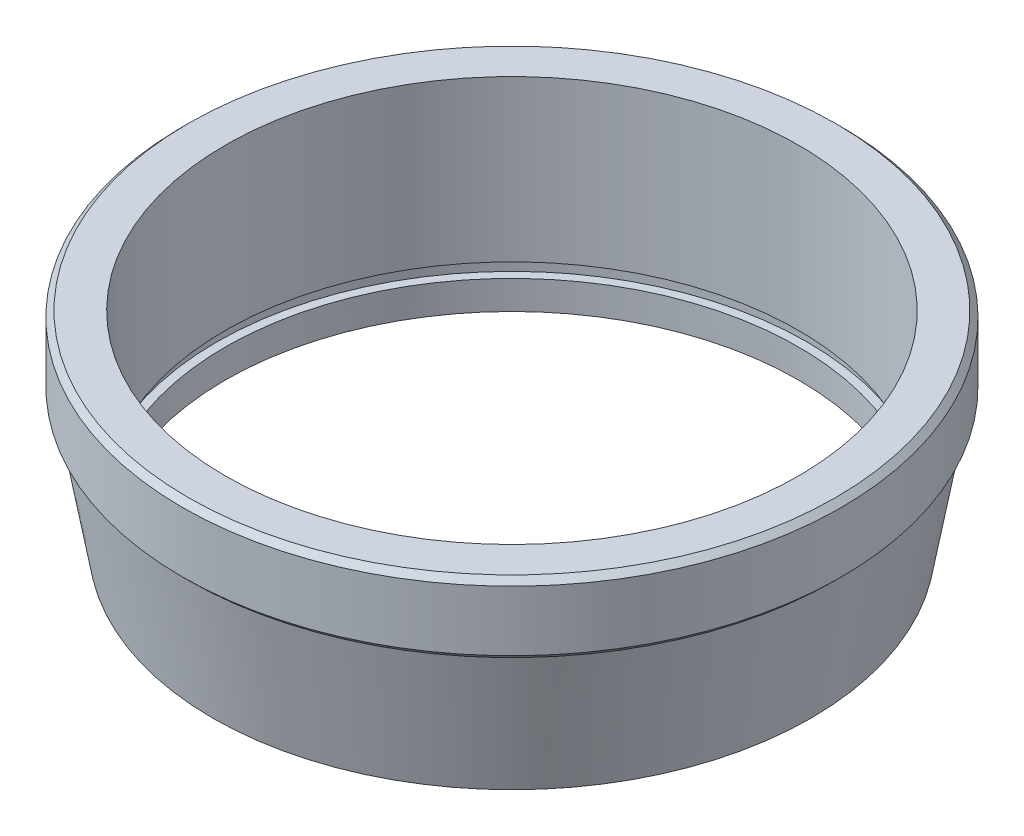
from build123d import *

# Parameters (mm, degrees)
SKICA1_R                 = 11.25
P_IDAT_VYSUNUT_M1_DEPTH  = 4.6
P_IDAT_VYSUNUT_M1_DRAFT  = -10
SKICA2_R                 = 11.5
P_IDAT_VYSUNUT_M2_DEPTH  = 2.5
ZKOSEN_1_SIZE            = 0.2
SKICA3_R                 = 10
ODEBRAT_VYSUNUT_M1_DEPTH = 2.5
ODEBRAT_START            = -4.6
SKICA4_R                 = 10
ODEBRAT_VYSUNUT_M2_DEPTH = 4.6
SKICA5_W                 = 0.3
SKICA5_H                 = 0.5


with BuildPart() as part:
    # Skica1 → P_idat vysunut_m1 (with draft: the straight prism first)
    with BuildSketch(Plane(origin=(0, 0, 0), x_dir=(1, 0, 0), z_dir=(0, 1, 0))):
        Circle(SKICA1_R)
    extrude(amount=-P_IDAT_VYSUNUT_M1_DEPTH)
    # P_idat vysunut_m1: the draft: its side faces are tilted about the plane it starts from
    p_idat_vysunut_m1_sides = [part.faces().sort_by_distance(p)[0] for p in [
        (-11.25, -2.3, 0),
    ]]
    draft(p_idat_vysunut_m1_sides, Plane(origin=(0, 0, 0), x_dir=(1, 0, 0), z_dir=(0, 1, 0)), P_IDAT_VYSUNUT_M1_DRAFT)

    # Skica2 → P_idat vysunut_m2 (add)
    with BuildSketch(Plane(origin=(0, 0, 0), x_dir=(-1, 0, 0), z_dir=(0, 1, 0))):
        with Locations(Location((0, 0, 0), (0, 0, 90))):
            Circle(SKICA2_R)
    extrude(amount=P_IDAT_VYSUNUT_M2_DEPTH)

    # Zkosen_1
    zkosen_1_edges = [part.edges().sort_by_distance(p)[0] for p in [
        (0, 0, -11.5),
        (0, 2.5, -11.5),
    ]]
    chamfer(zkosen_1_edges, length=ZKOSEN_1_SIZE)

    # Skica3 → Odebrat vysunut_m1 (cut)
    with BuildSketch(Plane(origin=(0, 2.5, 0), x_dir=(1, 0, 0), z_dir=(0, 1, 0))):
        with Locations(Location((0, 0, 0), (0, 0, 270))):
            Circle(SKICA3_R)
    extrude(amount=-ODEBRAT_VYSUNUT_M1_DEPTH, mode=Mode.SUBTRACT)

    # Skica4 → Odebrat vysunut_m2 (cut)
    with BuildSketch(Plane.XZ.offset(4.6).offset(ODEBRAT_START)):
        with Locations(Location((0, 0, 0), (0, 0, 90))):
            Circle(SKICA4_R)
    extrude(amount=ODEBRAT_VYSUNUT_M2_DEPTH, mode=Mode.SUBTRACT)

    # Skica5 → Odebrat rotac_1 (revolve, cut)
    with BuildSketch(Plane.XY, mode=Mode.PRIVATE) as odebrat_rotac_1_sk:
        with Locations((-10.15, -3.35)):
            Rectangle(SKICA5_W, SKICA5_H)
    revolve(odebrat_rotac_1_sk.sketch.rotate(Axis((0, 2.5, 0), (0, -1, 0)), 270), axis=Axis((0, 2.5, 0), (0, -1, 0)), mode=Mode.SUBTRACT)


solid = part.part
